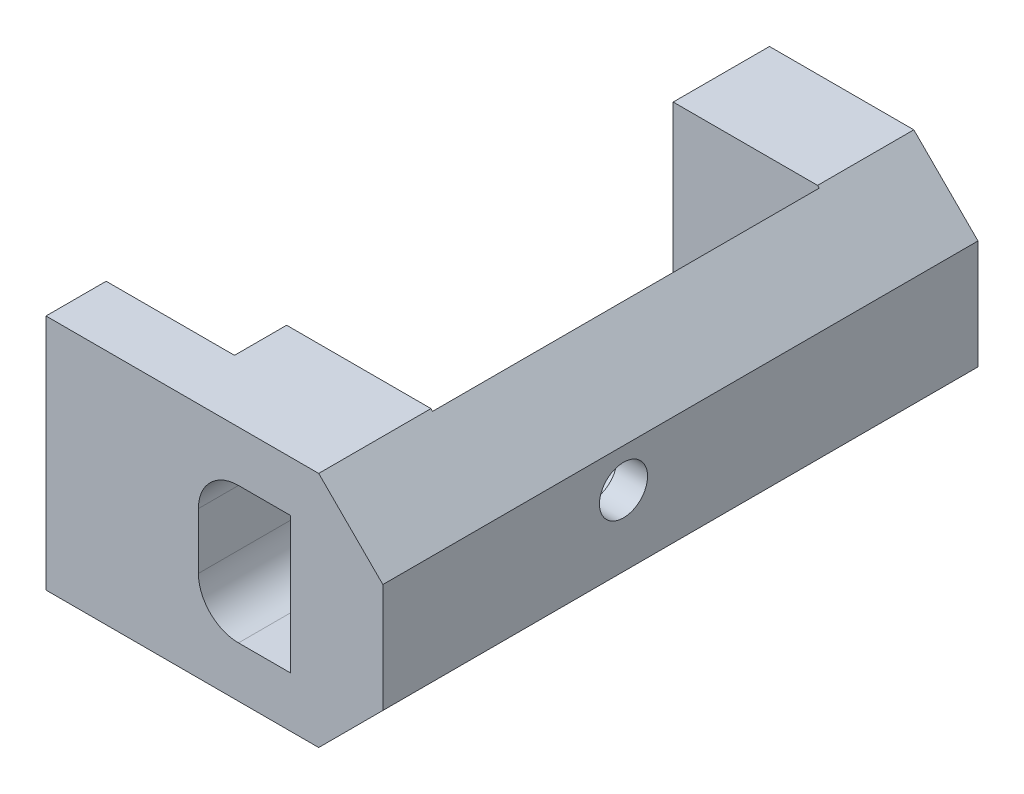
ISO-10303-21;
HEADER;
FILE_DESCRIPTION(('STEP AP214'),'2;1');
FILE_NAME('part.step','',(''),(''),'','','');
FILE_SCHEMA(('AUTOMOTIVE_DESIGN { 1 0 10303 214 1 1 1 1 }'));
ENDSEC;
DATA;
#1=APPLICATION_CONTEXT('core data for automotive mechanical design processes');
#2=APPLICATION_PROTOCOL_DEFINITION('international standard','automotive_design',2000,#1);
#3=PRODUCT_CONTEXT('',#1,'mechanical');
#4=PRODUCT('Part','Part','',(#3));
#5=PRODUCT_RELATED_PRODUCT_CATEGORY('part','',(#4));
#6=PRODUCT_DEFINITION_FORMATION('','',#4);
#7=PRODUCT_DEFINITION_CONTEXT('part definition',#1,'design');
#8=PRODUCT_DEFINITION('design','',#6,#7);
#9=PRODUCT_DEFINITION_SHAPE('','',#8);
#10=(LENGTH_UNIT() NAMED_UNIT(*) SI_UNIT(.MILLI.,.METRE.));
#11=(NAMED_UNIT(*) PLANE_ANGLE_UNIT() SI_UNIT($,.RADIAN.));
#12=(NAMED_UNIT(*) SI_UNIT($,.STERADIAN.) SOLID_ANGLE_UNIT());
#13=UNCERTAINTY_MEASURE_WITH_UNIT(LENGTH_MEASURE(1.E-05),#10,'distance_accuracy_value','');
#14=(GEOMETRIC_REPRESENTATION_CONTEXT(3) GLOBAL_UNCERTAINTY_ASSIGNED_CONTEXT((#13)) GLOBAL_UNIT_ASSIGNED_CONTEXT((#10,
#11,#12)) REPRESENTATION_CONTEXT('',''));
#15=CARTESIAN_POINT('',(0.,0.,0.));
#16=DIRECTION('',(0.,0.,1.));
#17=DIRECTION('',(1.,0.,0.));
#18=AXIS2_PLACEMENT_3D('',#15,#16,#17);
#19=CARTESIAN_POINT('',(0.,14.8,0.));
#20=DIRECTION('',(0.,-1.,0.));
#21=DIRECTION('',(0.,0.,-1.));
#22=AXIS2_PLACEMENT_3D('',#19,#20,#21);
#23=PLANE('',#22);
#24=DIRECTION('',(1.,0.,0.));
#25=VECTOR('',#24,1.);
#26=CARTESIAN_POINT('',(0.,14.8,-4.));
#27=LINE('',#26,#25);
#28=CARTESIAN_POINT('',(0.,14.8,-4.));
#29=VERTEX_POINT('',#28);
#30=CARTESIAN_POINT('',(8.99999999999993,14.8,-4.));
#31=VERTEX_POINT('',#30);
#32=EDGE_CURVE('E226',#29,#31,#27,.T.);
#33=ORIENTED_EDGE('',*,*,#32,.F.);
#34=DIRECTION('',(0.,0.,1.));
#35=VECTOR('',#34,1.);
#36=CARTESIAN_POINT('',(0.,14.8,0.));
#37=LINE('',#36,#35);
#38=CARTESIAN_POINT('',(0.,14.8,-0.750000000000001));
#39=VERTEX_POINT('',#38);
#40=EDGE_CURVE('E225',#29,#39,#37,.T.);
#41=ORIENTED_EDGE('',*,*,#40,.T.);
#42=DIRECTION('',(1.,0.,0.));
#43=VECTOR('',#42,1.);
#44=CARTESIAN_POINT('',(-8.,14.8,-0.749999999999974));
#45=LINE('',#44,#43);
#46=CARTESIAN_POINT('',(-8.,14.8,-0.749999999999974));
#47=VERTEX_POINT('',#46);
#48=EDGE_CURVE('E365',#47,#39,#45,.T.);
#49=ORIENTED_EDGE('',*,*,#48,.F.);
#50=DIRECTION('',(0.,0.,-1.));
#51=VECTOR('',#50,1.);
#52=CARTESIAN_POINT('',(-8.,14.8,0.));
#53=LINE('',#52,#51);
#54=CARTESIAN_POINT('',(-7.99999999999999,14.8,3.00000000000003));
#55=VERTEX_POINT('',#54);
#56=EDGE_CURVE('E363',#55,#47,#53,.T.);
#57=ORIENTED_EDGE('',*,*,#56,.F.);
#58=DIRECTION('',(-1.,0.,0.));
#59=VECTOR('',#58,1.);
#60=CARTESIAN_POINT('',(8.99999999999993,14.8,3.));
#61=LINE('',#60,#59);
#62=CARTESIAN_POINT('',(8.99999999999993,14.8,3.));
#63=VERTEX_POINT('',#62);
#64=EDGE_CURVE('E382',#63,#55,#61,.T.);
#65=ORIENTED_EDGE('',*,*,#64,.F.);
#66=DIRECTION('',(0.,0.,-1.));
#67=VECTOR('',#66,1.);
#68=CARTESIAN_POINT('',(8.99999999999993,14.8,0.));
#69=LINE('',#68,#67);
#70=EDGE_CURVE('E256',#63,#31,#69,.T.);
#71=ORIENTED_EDGE('',*,*,#70,.T.);
#72=EDGE_LOOP('',(#33,#41,#49,#57,#65,#71));
#73=FACE_BOUND('',#72,.T.);
#74=ADVANCED_FACE('F35',(#73),#23,.F.);
#75=CARTESIAN_POINT('',(0.,14.8,0.));
#76=DIRECTION('',(1.,0.,0.));
#77=DIRECTION('',(0.,0.,-1.));
#78=AXIS2_PLACEMENT_3D('',#75,#76,#77);
#79=PLANE('',#78);
#80=DIRECTION('',(0.,1.,0.));
#81=VECTOR('',#80,1.);
#82=CARTESIAN_POINT('',(0.,0.,-4.));
#83=LINE('',#82,#81);
#84=CARTESIAN_POINT('',(0.,0.,-4.));
#85=VERTEX_POINT('',#84);
#86=EDGE_CURVE('E211',#85,#29,#83,.T.);
#87=ORIENTED_EDGE('',*,*,#86,.F.);
#88=DIRECTION('',(0.,0.,1.));
#89=VECTOR('',#88,1.);
#90=CARTESIAN_POINT('',(0.,0.,0.));
#91=LINE('',#90,#89);
#92=CARTESIAN_POINT('',(0.,0.,-0.750000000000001));
#93=VERTEX_POINT('',#92);
#94=EDGE_CURVE('E223',#85,#93,#91,.T.);
#95=ORIENTED_EDGE('',*,*,#94,.T.);
#96=DIRECTION('',(0.,1.,0.));
#97=VECTOR('',#96,1.);
#98=CARTESIAN_POINT('',(0.,0.,-0.750000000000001));
#99=LINE('',#98,#97);
#100=EDGE_CURVE('E344',#93,#39,#99,.T.);
#101=ORIENTED_EDGE('',*,*,#100,.T.);
#102=ORIENTED_EDGE('',*,*,#40,.F.);
#103=EDGE_LOOP('',(#87,#95,#101,#102));
#104=FACE_BOUND('',#103,.T.);
#105=ADVANCED_FACE('F221',(#104),#79,.F.);
#106=CARTESIAN_POINT('',(0.,0.,0.));
#107=DIRECTION('',(0.,-1.,0.));
#108=DIRECTION('',(0.,0.,-1.));
#109=AXIS2_PLACEMENT_3D('',#106,#107,#108);
#110=PLANE('',#109);
#111=ORIENTED_EDGE('',*,*,#94,.F.);
#112=DIRECTION('',(-1.,0.,0.));
#113=VECTOR('',#112,1.);
#114=CARTESIAN_POINT('',(8.99999999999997,0.,-4.));
#115=LINE('',#114,#113);
#116=CARTESIAN_POINT('',(8.99999999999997,0.,-4.));
#117=VERTEX_POINT('',#116);
#118=EDGE_CURVE('E208',#117,#85,#115,.T.);
#119=ORIENTED_EDGE('',*,*,#118,.F.);
#120=DIRECTION('',(0.,0.,1.));
#121=VECTOR('',#120,1.);
#122=CARTESIAN_POINT('',(8.99999999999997,0.,0.));
#123=LINE('',#122,#121);
#124=CARTESIAN_POINT('',(8.99999999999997,0.,3.));
#125=VERTEX_POINT('',#124);
#126=EDGE_CURVE('E270',#117,#125,#123,.T.);
#127=ORIENTED_EDGE('',*,*,#126,.T.);
#128=DIRECTION('',(1.,0.,0.));
#129=VECTOR('',#128,1.);
#130=CARTESIAN_POINT('',(0.,0.,3.));
#131=LINE('',#130,#129);
#132=CARTESIAN_POINT('',(-7.99999999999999,0.,3.00000000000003));
#133=VERTEX_POINT('',#132);
#134=EDGE_CURVE('E370',#133,#125,#131,.T.);
#135=ORIENTED_EDGE('',*,*,#134,.F.);
#136=DIRECTION('',(0.,0.,1.));
#137=VECTOR('',#136,1.);
#138=CARTESIAN_POINT('',(-8.,0.,0.));
#139=LINE('',#138,#137);
#140=CARTESIAN_POINT('',(-8.,0.,-0.749999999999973));
#141=VERTEX_POINT('',#140);
#142=EDGE_CURVE('E357',#141,#133,#139,.T.);
#143=ORIENTED_EDGE('',*,*,#142,.F.);
#144=DIRECTION('',(1.,0.,0.));
#145=VECTOR('',#144,1.);
#146=CARTESIAN_POINT('',(-8.,0.,-0.749999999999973));
#147=LINE('',#146,#145);
#148=EDGE_CURVE('E230',#141,#93,#147,.T.);
#149=ORIENTED_EDGE('',*,*,#148,.T.);
#150=EDGE_LOOP('',(#111,#119,#127,#135,#143,#149));
#151=FACE_BOUND('',#150,.T.);
#152=ADVANCED_FACE('F228',(#151),#110,.T.);
#153=CARTESIAN_POINT('',(4.,9.15,-5.));
#154=DIRECTION('',(0.,0.,1.));
#155=DIRECTION('',(1.,0.,0.));
#156=AXIS2_PLACEMENT_3D('',#153,#154,#155);
#157=CYLINDRICAL_SURFACE('',#156,2.5);
#158=CARTESIAN_POINT('',(4.,9.15,-4.));
#159=DIRECTION('',(0.,0.,-1.));
#160=DIRECTION('',(-1.,0.,0.));
#161=AXIS2_PLACEMENT_3D('',#158,#159,#160);
#162=CIRCLE('',#161,2.5);
#163=CARTESIAN_POINT('',(4.,11.65,-4.));
#164=VERTEX_POINT('',#163);
#165=CARTESIAN_POINT('',(1.5,9.15,-4.));
#166=VERTEX_POINT('',#165);
#167=EDGE_CURVE('E57',#164,#166,#162,.F.);
#168=ORIENTED_EDGE('',*,*,#167,.F.);
#169=DIRECTION('',(0.,0.,1.));
#170=VECTOR('',#169,1.);
#171=CARTESIAN_POINT('',(4.,11.65,-5.));
#172=LINE('',#171,#170);
#173=CARTESIAN_POINT('',(4.,11.65,3.));
#174=VERTEX_POINT('',#173);
#175=EDGE_CURVE('E342',#164,#174,#172,.T.);
#176=ORIENTED_EDGE('',*,*,#175,.T.);
#177=CARTESIAN_POINT('',(4.,9.15,3.));
#178=DIRECTION('',(0.,0.,1.));
#179=DIRECTION('',(1.,0.,0.));
#180=AXIS2_PLACEMENT_3D('',#177,#178,#179);
#181=CIRCLE('',#180,2.5);
#182=CARTESIAN_POINT('',(1.5,9.15,3.));
#183=VERTEX_POINT('',#182);
#184=EDGE_CURVE('E323',#174,#183,#181,.T.);
#185=ORIENTED_EDGE('',*,*,#184,.T.);
#186=DIRECTION('',(0.,0.,1.));
#187=VECTOR('',#186,1.);
#188=CARTESIAN_POINT('',(1.5,9.15,-5.));
#189=LINE('',#188,#187);
#190=EDGE_CURVE('E341',#166,#183,#189,.T.);
#191=ORIENTED_EDGE('',*,*,#190,.F.);
#192=EDGE_LOOP('',(#168,#176,#185,#191));
#193=FACE_BOUND('',#192,.T.);
#194=ADVANCED_FACE('F486',(#193),#157,.F.);
#195=CARTESIAN_POINT('',(7.25,11.65,-5.));
#196=DIRECTION('',(0.,1.,0.));
#197=DIRECTION('',(0.,0.,1.));
#198=AXIS2_PLACEMENT_3D('',#195,#196,#197);
#199=PLANE('',#198);
#200=DIRECTION('',(-1.,0.,0.));
#201=VECTOR('',#200,1.);
#202=CARTESIAN_POINT('',(7.25,11.65,-4.));
#203=LINE('',#202,#201);
#204=CARTESIAN_POINT('',(7.25,11.65,-4.));
#205=VERTEX_POINT('',#204);
#206=EDGE_CURVE('E299',#205,#164,#203,.T.);
#207=ORIENTED_EDGE('',*,*,#206,.F.);
#208=DIRECTION('',(0.,0.,1.));
#209=VECTOR('',#208,1.);
#210=CARTESIAN_POINT('',(7.25,11.65,-5.));
#211=LINE('',#210,#209);
#212=CARTESIAN_POINT('',(7.25,11.65,3.));
#213=VERTEX_POINT('',#212);
#214=EDGE_CURVE('E345',#205,#213,#211,.T.);
#215=ORIENTED_EDGE('',*,*,#214,.T.);
#216=DIRECTION('',(-1.,0.,0.));
#217=VECTOR('',#216,1.);
#218=CARTESIAN_POINT('',(7.25,11.65,3.));
#219=LINE('',#218,#217);
#220=EDGE_CURVE('E338',#213,#174,#219,.T.);
#221=ORIENTED_EDGE('',*,*,#220,.T.);
#222=ORIENTED_EDGE('',*,*,#175,.F.);
#223=EDGE_LOOP('',(#207,#215,#221,#222));
#224=FACE_BOUND('',#223,.T.);
#225=ADVANCED_FACE('F490',(#224),#199,.F.);
#226=CARTESIAN_POINT('',(7.25,11.65,-5.));
#227=DIRECTION('',(1.,0.,0.));
#228=DIRECTION('',(0.,0.,-1.));
#229=AXIS2_PLACEMENT_3D('',#226,#227,#228);
#230=PLANE('',#229);
#231=DIRECTION('',(0.,1.,0.));
#232=VECTOR('',#231,1.);
#233=CARTESIAN_POINT('',(7.25,11.65,-4.));
#234=LINE('',#233,#232);
#235=CARTESIAN_POINT('',(7.25,3.15,-4.));
#236=VERTEX_POINT('',#235);
#237=EDGE_CURVE('E297',#236,#205,#234,.T.);
#238=ORIENTED_EDGE('',*,*,#237,.F.);
#239=DIRECTION('',(0.,0.,1.));
#240=VECTOR('',#239,1.);
#241=CARTESIAN_POINT('',(7.25,3.15,-5.));
#242=LINE('',#241,#240);
#243=CARTESIAN_POINT('',(7.25,3.15,3.));
#244=VERTEX_POINT('',#243);
#245=EDGE_CURVE('E347',#236,#244,#242,.T.);
#246=ORIENTED_EDGE('',*,*,#245,.T.);
#247=DIRECTION('',(0.,1.,0.));
#248=VECTOR('',#247,1.);
#249=CARTESIAN_POINT('',(7.25,11.65,3.));
#250=LINE('',#249,#248);
#251=EDGE_CURVE('E335',#244,#213,#250,.T.);
#252=ORIENTED_EDGE('',*,*,#251,.T.);
#253=ORIENTED_EDGE('',*,*,#214,.F.);
#254=EDGE_LOOP('',(#238,#246,#252,#253));
#255=FACE_BOUND('',#254,.T.);
#256=ADVANCED_FACE('F680',(#255),#230,.F.);
#257=CARTESIAN_POINT('',(7.25,3.15,-5.));
#258=DIRECTION('',(0.,-1.,0.));
#259=DIRECTION('',(1.,0.,0.));
#260=AXIS2_PLACEMENT_3D('',#257,#258,#259);
#261=PLANE('',#260);
#262=DIRECTION('',(1.,0.,0.));
#263=VECTOR('',#262,1.);
#264=CARTESIAN_POINT('',(7.25,3.15,-4.));
#265=LINE('',#264,#263);
#266=CARTESIAN_POINT('',(4.,3.15,-4.));
#267=VERTEX_POINT('',#266);
#268=EDGE_CURVE('E290',#267,#236,#265,.T.);
#269=ORIENTED_EDGE('',*,*,#268,.F.);
#270=DIRECTION('',(0.,0.,1.));
#271=VECTOR('',#270,1.);
#272=CARTESIAN_POINT('',(4.,3.15,-5.));
#273=LINE('',#272,#271);
#274=CARTESIAN_POINT('',(4.,3.15,3.));
#275=VERTEX_POINT('',#274);
#276=EDGE_CURVE('E349',#267,#275,#273,.T.);
#277=ORIENTED_EDGE('',*,*,#276,.T.);
#278=DIRECTION('',(1.,0.,0.));
#279=VECTOR('',#278,1.);
#280=CARTESIAN_POINT('',(7.25,3.15,3.));
#281=LINE('',#280,#279);
#282=EDGE_CURVE('E332',#275,#244,#281,.T.);
#283=ORIENTED_EDGE('',*,*,#282,.T.);
#284=ORIENTED_EDGE('',*,*,#245,.F.);
#285=EDGE_LOOP('',(#269,#277,#283,#284));
#286=FACE_BOUND('',#285,.T.);
#287=ADVANCED_FACE('F506',(#286),#261,.F.);
#288=CARTESIAN_POINT('',(4.,5.65,-5.));
#289=DIRECTION('',(0.,0.,1.));
#290=DIRECTION('',(1.,0.,0.));
#291=AXIS2_PLACEMENT_3D('',#288,#289,#290);
#292=CYLINDRICAL_SURFACE('',#291,2.5);
#293=CARTESIAN_POINT('',(4.,5.65,-4.));
#294=DIRECTION('',(0.,0.,-1.));
#295=DIRECTION('',(-1.,0.,0.));
#296=AXIS2_PLACEMENT_3D('',#293,#294,#295);
#297=CIRCLE('',#296,2.5);
#298=CARTESIAN_POINT('',(1.5,5.65,-4.));
#299=VERTEX_POINT('',#298);
#300=EDGE_CURVE('E287',#299,#267,#297,.F.);
#301=ORIENTED_EDGE('',*,*,#300,.F.);
#302=DIRECTION('',(0.,0.,1.));
#303=VECTOR('',#302,1.);
#304=CARTESIAN_POINT('',(1.5,5.65,-5.));
#305=LINE('',#304,#303);
#306=CARTESIAN_POINT('',(1.5,5.65,3.));
#307=VERTEX_POINT('',#306);
#308=EDGE_CURVE('E351',#299,#307,#305,.T.);
#309=ORIENTED_EDGE('',*,*,#308,.T.);
#310=CARTESIAN_POINT('',(4.,5.65,3.));
#311=DIRECTION('',(0.,0.,1.));
#312=DIRECTION('',(1.,0.,0.));
#313=AXIS2_PLACEMENT_3D('',#310,#311,#312);
#314=CIRCLE('',#313,2.5);
#315=EDGE_CURVE('E329',#307,#275,#314,.T.);
#316=ORIENTED_EDGE('',*,*,#315,.T.);
#317=ORIENTED_EDGE('',*,*,#276,.F.);
#318=EDGE_LOOP('',(#301,#309,#316,#317));
#319=FACE_BOUND('',#318,.T.);
#320=ADVANCED_FACE('F500',(#319),#292,.F.);
#321=CARTESIAN_POINT('',(1.5,9.15,-5.));
#322=DIRECTION('',(-1.,0.,0.));
#323=DIRECTION('',(0.,-1.,0.));
#324=AXIS2_PLACEMENT_3D('',#321,#322,#323);
#325=PLANE('',#324);
#326=DIRECTION('',(0.,-1.,0.));
#327=VECTOR('',#326,1.);
#328=CARTESIAN_POINT('',(1.5,9.15,-4.));
#329=LINE('',#328,#327);
#330=EDGE_CURVE('E11',#166,#299,#329,.T.);
#331=ORIENTED_EDGE('',*,*,#330,.F.);
#332=ORIENTED_EDGE('',*,*,#190,.T.);
#333=DIRECTION('',(0.,-1.,0.));
#334=VECTOR('',#333,1.);
#335=CARTESIAN_POINT('',(1.5,9.15,3.));
#336=LINE('',#335,#334);
#337=EDGE_CURVE('E326',#183,#307,#336,.T.);
#338=ORIENTED_EDGE('',*,*,#337,.T.);
#339=ORIENTED_EDGE('',*,*,#308,.F.);
#340=EDGE_LOOP('',(#331,#332,#338,#339));
#341=FACE_BOUND('',#340,.T.);
#342=ADVANCED_FACE('F494',(#341),#325,.F.);
#343=DIRECTION('',(0.,0.,1.));
#344=VECTOR('',#343,1.);
#345=CARTESIAN_POINT('',(0.,0.,-33.1));
#346=LINE('',#345,#344);
#347=CARTESIAN_POINT('',(0.,0.,-34.1));
#348=VERTEX_POINT('',#347);
#349=CARTESIAN_POINT('',(0.,0.,-28.1));
#350=VERTEX_POINT('',#349);
#351=EDGE_CURVE('E232',#348,#350,#346,.T.);
#352=ORIENTED_EDGE('',*,*,#351,.F.);
#353=DIRECTION('',(-1.,0.,0.));
#354=VECTOR('',#353,1.);
#355=CARTESIAN_POINT('',(0.,0.,-34.1));
#356=LINE('',#355,#354);
#357=CARTESIAN_POINT('',(8.99999999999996,0.,-34.1));
#358=VERTEX_POINT('',#357);
#359=EDGE_CURVE('E276',#358,#348,#356,.T.);
#360=ORIENTED_EDGE('',*,*,#359,.F.);
#361=DIRECTION('',(0.,0.,1.));
#362=VECTOR('',#361,1.);
#363=CARTESIAN_POINT('',(8.99999999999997,0.,0.));
#364=LINE('',#363,#362);
#365=CARTESIAN_POINT('',(8.99999999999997,0.,-28.1));
#366=VERTEX_POINT('',#365);
#367=EDGE_CURVE('E43',#358,#366,#364,.T.);
#368=ORIENTED_EDGE('',*,*,#367,.T.);
#369=DIRECTION('',(1.,0.,0.));
#370=VECTOR('',#369,1.);
#371=CARTESIAN_POINT('',(0.,0.,-28.1));
#372=LINE('',#371,#370);
#373=EDGE_CURVE('E235',#350,#366,#372,.T.);
#374=ORIENTED_EDGE('',*,*,#373,.F.);
#375=EDGE_LOOP('',(#352,#360,#368,#374));
#376=FACE_BOUND('',#375,.T.);
#377=ADVANCED_FACE('F274',(#376),#110,.T.);
#378=CARTESIAN_POINT('',(3.,8.4,-12.));
#379=DIRECTION('',(1.,0.,0.));
#380=DIRECTION('',(0.,0.,-1.));
#381=AXIS2_PLACEMENT_3D('',#378,#379,#380);
#382=CYLINDRICAL_SURFACE('',#381,1.5);
#383=CARTESIAN_POINT('',(13.,8.4,-12.));
#384=DIRECTION('',(1.,0.,0.));
#385=DIRECTION('',(0.,0.,-1.));
#386=AXIS2_PLACEMENT_3D('',#383,#384,#385);
#387=CIRCLE('',#386,1.5);
#388=CARTESIAN_POINT('',(13.,8.4,-13.5));
#389=VERTEX_POINT('',#388);
#390=EDGE_CURVE('E233',#389,#389,#387,.T.);
#391=ORIENTED_EDGE('',*,*,#390,.T.);
#392=EDGE_LOOP('',(#391));
#393=FACE_BOUND('',#392,.T.);
#394=CARTESIAN_POINT('',(11.1,8.4,-12.));
#395=DIRECTION('',(-1.,0.,0.));
#396=DIRECTION('',(0.,0.,1.));
#397=AXIS2_PLACEMENT_3D('',#394,#395,#396);
#398=CIRCLE('',#397,1.5);
#399=CARTESIAN_POINT('',(11.1,8.4,-10.5));
#400=VERTEX_POINT('',#399);
#401=EDGE_CURVE('E238',#400,#400,#398,.F.);
#402=ORIENTED_EDGE('',*,*,#401,.F.);
#403=EDGE_LOOP('',(#402));
#404=FACE_BOUND('',#403,.T.);
#405=ADVANCED_FACE('F458',(#393,#404),#382,.F.);
#406=CARTESIAN_POINT('',(13.,14.8,0.));
#407=DIRECTION('',(-1.,0.,0.));
#408=DIRECTION('',(0.,0.,1.));
#409=AXIS2_PLACEMENT_3D('',#406,#407,#408);
#410=PLANE('',#409);
#411=ORIENTED_EDGE('',*,*,#390,.F.);
#412=EDGE_LOOP('',(#411));
#413=FACE_BOUND('',#412,.T.);
#414=DIRECTION('',(0.,0.,-1.));
#415=VECTOR('',#414,1.);
#416=CARTESIAN_POINT('',(13.,4.00000000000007,-33.1));
#417=LINE('',#416,#415);
#418=CARTESIAN_POINT('',(13.,4.00000000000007,3.));
#419=VERTEX_POINT('',#418);
#420=CARTESIAN_POINT('',(13.,4.00000000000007,-34.1));
#421=VERTEX_POINT('',#420);
#422=EDGE_CURVE('E266',#419,#421,#417,.T.);
#423=ORIENTED_EDGE('',*,*,#422,.T.);
#424=DIRECTION('',(0.,-1.,0.));
#425=VECTOR('',#424,1.);
#426=CARTESIAN_POINT('',(13.,4.00000000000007,-34.1));
#427=LINE('',#426,#425);
#428=CARTESIAN_POINT('',(13.,10.8,-34.1));
#429=VERTEX_POINT('',#428);
#430=EDGE_CURVE('E314',#429,#421,#427,.T.);
#431=ORIENTED_EDGE('',*,*,#430,.F.);
#432=DIRECTION('',(0.,0.,1.));
#433=VECTOR('',#432,1.);
#434=CARTESIAN_POINT('',(13.,10.8,0.));
#435=LINE('',#434,#433);
#436=CARTESIAN_POINT('',(13.,10.8,3.));
#437=VERTEX_POINT('',#436);
#438=EDGE_CURVE('E268',#429,#437,#435,.T.);
#439=ORIENTED_EDGE('',*,*,#438,.T.);
#440=DIRECTION('',(0.,1.,0.));
#441=VECTOR('',#440,1.);
#442=CARTESIAN_POINT('',(13.,4.00000000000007,3.));
#443=LINE('',#442,#441);
#444=EDGE_CURVE('E376',#419,#437,#443,.T.);
#445=ORIENTED_EDGE('',*,*,#444,.F.);
#446=EDGE_LOOP('',(#423,#431,#439,#445));
#447=FACE_BOUND('',#446,.T.);
#448=ADVANCED_FACE('F449',(#413,#447),#410,.F.);
#449=CARTESIAN_POINT('',(0.,14.8,-33.1));
#450=DIRECTION('',(1.,0.,0.));
#451=DIRECTION('',(0.,0.,-1.));
#452=AXIS2_PLACEMENT_3D('',#449,#450,#451);
#453=PLANE('',#452);
#454=CARTESIAN_POINT('',(1.01164552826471E-13,8.4,-31.1));
#455=DIRECTION('',(-1.,0.,0.));
#456=DIRECTION('',(0.,0.,1.));
#457=AXIS2_PLACEMENT_3D('',#454,#455,#456);
#458=CIRCLE('',#457,1.);
#459=CARTESIAN_POINT('',(0.,8.4,-30.1));
#460=VERTEX_POINT('',#459);
#461=EDGE_CURVE('E302',#460,#460,#458,.T.);
#462=ORIENTED_EDGE('',*,*,#461,.F.);
#463=EDGE_LOOP('',(#462));
#464=FACE_BOUND('',#463,.T.);
#465=ORIENTED_EDGE('',*,*,#351,.T.);
#466=DIRECTION('',(0.,-1.,0.));
#467=VECTOR('',#466,1.);
#468=CARTESIAN_POINT('',(0.,14.8,-28.1));
#469=LINE('',#468,#467);
#470=CARTESIAN_POINT('',(0.,14.8,-28.1));
#471=VERTEX_POINT('',#470);
#472=EDGE_CURVE('E248',#471,#350,#469,.T.);
#473=ORIENTED_EDGE('',*,*,#472,.F.);
#474=DIRECTION('',(0.,0.,1.));
#475=VECTOR('',#474,1.);
#476=CARTESIAN_POINT('',(0.,14.8,-33.1));
#477=LINE('',#476,#475);
#478=CARTESIAN_POINT('',(0.,14.8,-34.1));
#479=VERTEX_POINT('',#478);
#480=EDGE_CURVE('E431',#479,#471,#477,.T.);
#481=ORIENTED_EDGE('',*,*,#480,.F.);
#482=DIRECTION('',(0.,1.,0.));
#483=VECTOR('',#482,1.);
#484=CARTESIAN_POINT('',(0.,14.8,-34.1));
#485=LINE('',#484,#483);
#486=EDGE_CURVE('E320',#348,#479,#485,.T.);
#487=ORIENTED_EDGE('',*,*,#486,.F.);
#488=EDGE_LOOP('',(#465,#473,#481,#487));
#489=FACE_BOUND('',#488,.T.);
#490=ADVANCED_FACE('F447',(#464,#489),#453,.F.);
#491=CARTESIAN_POINT('',(0.,14.8,-28.1));
#492=DIRECTION('',(0.,0.,-1.));
#493=DIRECTION('',(-1.,0.,0.));
#494=AXIS2_PLACEMENT_3D('',#491,#492,#493);
#495=PLANE('',#494);
#496=DIRECTION('',(0.,-1.,0.));
#497=VECTOR('',#496,1.);
#498=CARTESIAN_POINT('',(9.09999999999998,14.8,-28.1));
#499=LINE('',#498,#497);
#500=CARTESIAN_POINT('',(9.09999999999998,14.6999999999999,-28.1));
#501=VERTEX_POINT('',#500);
#502=CARTESIAN_POINT('',(9.09999999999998,0.100000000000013,-28.1));
#503=VERTEX_POINT('',#502);
#504=EDGE_CURVE('E246',#501,#503,#499,.T.);
#505=ORIENTED_EDGE('',*,*,#504,.F.);
#506=DIRECTION('',(0.707106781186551,-0.707106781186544,0.));
#507=VECTOR('',#506,1.);
#508=CARTESIAN_POINT('',(8.99999999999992,14.8,-28.1));
#509=LINE('',#508,#507);
#510=CARTESIAN_POINT('',(8.99999999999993,14.8,-28.1));
#511=VERTEX_POINT('',#510);
#512=EDGE_CURVE('E264',#501,#511,#509,.F.);
#513=ORIENTED_EDGE('',*,*,#512,.T.);
#514=DIRECTION('',(1.,0.,0.));
#515=VECTOR('',#514,1.);
#516=CARTESIAN_POINT('',(0.,14.8,-28.1));
#517=LINE('',#516,#515);
#518=EDGE_CURVE('E241',#471,#511,#517,.T.);
#519=ORIENTED_EDGE('',*,*,#518,.F.);
#520=ORIENTED_EDGE('',*,*,#472,.T.);
#521=ORIENTED_EDGE('',*,*,#373,.T.);
#522=DIRECTION('',(0.707106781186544,0.707106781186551,0.));
#523=VECTOR('',#522,1.);
#524=CARTESIAN_POINT('',(13.,4.00000000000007,-28.1));
#525=LINE('',#524,#523);
#526=EDGE_CURVE('E262',#366,#503,#525,.T.);
#527=ORIENTED_EDGE('',*,*,#526,.T.);
#528=EDGE_LOOP('',(#505,#513,#519,#520,#521,#527));
#529=FACE_BOUND('',#528,.T.);
#530=ADVANCED_FACE('F283',(#529),#495,.F.);
#531=CARTESIAN_POINT('',(9.09999999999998,14.8,-5.));
#532=DIRECTION('',(1.,0.,0.));
#533=DIRECTION('',(0.,0.,-1.));
#534=AXIS2_PLACEMENT_3D('',#531,#532,#533);
#535=PLANE('',#534);
#536=DIRECTION('',(0.,-0.429835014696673,-0.902907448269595));
#537=VECTOR('',#536,1.);
#538=CARTESIAN_POINT('',(9.09999999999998,11.6896323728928,-11.7386212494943));
#539=LINE('',#538,#537);
#540=CARTESIAN_POINT('',(9.09999999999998,11.6896323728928,-11.7386212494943));
#541=VERTEX_POINT('',#540);
#542=CARTESIAN_POINT('',(9.09999999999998,10.2711768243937,-14.718215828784));
#543=VERTEX_POINT('',#542);
#544=EDGE_CURVE('E406',#541,#543,#539,.T.);
#545=ORIENTED_EDGE('',*,*,#544,.F.);
#546=DIRECTION('',(0.,0.567023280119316,-0.823701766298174));
#547=VECTOR('',#546,1.);
#548=CARTESIAN_POINT('',(9.09999999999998,9.81845554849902,-9.02040542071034));
#549=LINE('',#548,#547);
#550=CARTESIAN_POINT('',(9.09999999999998,9.81845554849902,-9.02040542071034));
#551=VERTEX_POINT('',#550);
#552=EDGE_CURVE('E384',#551,#541,#549,.T.);
#553=ORIENTED_EDGE('',*,*,#552,.F.);
#554=DIRECTION('',(0.,0.996858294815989,0.0792056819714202));
#555=VECTOR('',#554,1.);
#556=CARTESIAN_POINT('',(9.09999999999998,6.52882317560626,-9.28178417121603));
#557=LINE('',#556,#555);
#558=CARTESIAN_POINT('',(9.09999999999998,6.52882317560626,-9.28178417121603));
#559=VERTEX_POINT('',#558);
#560=EDGE_CURVE('E389',#559,#551,#557,.T.);
#561=ORIENTED_EDGE('',*,*,#560,.F.);
#562=DIRECTION('',(0.,0.429835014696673,0.902907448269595));
#563=VECTOR('',#562,1.);
#564=CARTESIAN_POINT('',(9.09999999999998,5.11036762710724,-12.2613787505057));
#565=LINE('',#564,#563);
#566=CARTESIAN_POINT('',(9.09999999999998,5.11036762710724,-12.2613787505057));
#567=VERTEX_POINT('',#566);
#568=EDGE_CURVE('E415',#567,#559,#565,.T.);
#569=ORIENTED_EDGE('',*,*,#568,.F.);
#570=DIRECTION('',(0.,-0.567023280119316,0.823701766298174));
#571=VECTOR('',#570,1.);
#572=CARTESIAN_POINT('',(9.09999999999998,6.98154445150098,-14.9795945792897));
#573=LINE('',#572,#571);
#574=CARTESIAN_POINT('',(9.09999999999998,6.98154445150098,-14.9795945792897));
#575=VERTEX_POINT('',#574);
#576=EDGE_CURVE('E412',#575,#567,#573,.T.);
#577=ORIENTED_EDGE('',*,*,#576,.F.);
#578=DIRECTION('',(0.,-0.99685829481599,-0.0792056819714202));
#579=VECTOR('',#578,1.);
#580=CARTESIAN_POINT('',(9.09999999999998,10.2711768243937,-14.718215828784));
#581=LINE('',#580,#579);
#582=EDGE_CURVE('E409',#543,#575,#581,.T.);
#583=ORIENTED_EDGE('',*,*,#582,.F.);
#584=EDGE_LOOP('',(#545,#553,#561,#569,#577,#583));
#585=FACE_BOUND('',#584,.T.);
#586=DIRECTION('',(0.,0.,1.));
#587=VECTOR('',#586,1.);
#588=CARTESIAN_POINT('',(9.09999999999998,0.100000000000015,0.));
#589=LINE('',#588,#587);
#590=CARTESIAN_POINT('',(9.09999999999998,0.100000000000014,-4.));
#591=VERTEX_POINT('',#590);
#592=EDGE_CURVE('E50',#503,#591,#589,.T.);
#593=ORIENTED_EDGE('',*,*,#592,.T.);
#594=DIRECTION('',(0.,-1.,0.));
#595=VECTOR('',#594,1.);
#596=CARTESIAN_POINT('',(9.09999999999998,14.6999999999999,-4.));
#597=LINE('',#596,#595);
#598=CARTESIAN_POINT('',(9.09999999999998,14.6999999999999,-4.));
#599=VERTEX_POINT('',#598);
#600=EDGE_CURVE('E288',#599,#591,#597,.T.);
#601=ORIENTED_EDGE('',*,*,#600,.F.);
#602=DIRECTION('',(0.,0.,1.));
#603=VECTOR('',#602,1.);
#604=CARTESIAN_POINT('',(9.09999999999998,14.6999999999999,0.));
#605=LINE('',#604,#603);
#606=EDGE_CURVE('E260',#599,#501,#605,.F.);
#607=ORIENTED_EDGE('',*,*,#606,.T.);
#608=ORIENTED_EDGE('',*,*,#504,.T.);
#609=EDGE_LOOP('',(#593,#601,#607,#608));
#610=FACE_BOUND('',#609,.T.);
#611=ADVANCED_FACE('F456',(#585,#610),#535,.F.);
#612=ORIENTED_EDGE('',*,*,#518,.T.);
#613=DIRECTION('',(0.,0.,-1.));
#614=VECTOR('',#613,1.);
#615=CARTESIAN_POINT('',(8.99999999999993,14.8,0.));
#616=LINE('',#615,#614);
#617=CARTESIAN_POINT('',(8.99999999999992,14.8,-34.1));
#618=VERTEX_POINT('',#617);
#619=EDGE_CURVE('E251',#511,#618,#616,.T.);
#620=ORIENTED_EDGE('',*,*,#619,.T.);
#621=DIRECTION('',(1.,0.,0.));
#622=VECTOR('',#621,1.);
#623=CARTESIAN_POINT('',(8.99999999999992,14.8,-34.1));
#624=LINE('',#623,#622);
#625=EDGE_CURVE('E306',#479,#618,#624,.T.);
#626=ORIENTED_EDGE('',*,*,#625,.F.);
#627=ORIENTED_EDGE('',*,*,#480,.T.);
#628=EDGE_LOOP('',(#612,#620,#626,#627));
#629=FACE_BOUND('',#628,.T.);
#630=ADVANCED_FACE('F436',(#629),#23,.F.);
#631=CARTESIAN_POINT('',(11.1,0.,0.));
#632=DIRECTION('',(-1.,0.,0.));
#633=DIRECTION('',(0.,0.,1.));
#634=AXIS2_PLACEMENT_3D('',#631,#632,#633);
#635=PLANE('',#634);
#636=DIRECTION('',(0.,0.567023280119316,-0.823701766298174));
#637=VECTOR('',#636,1.);
#638=CARTESIAN_POINT('',(11.1,9.81845554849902,-9.02040542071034));
#639=LINE('',#638,#637);
#640=CARTESIAN_POINT('',(11.1,9.81845554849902,-9.02040542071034));
#641=VERTEX_POINT('',#640);
#642=CARTESIAN_POINT('',(11.1,11.6896323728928,-11.7386212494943));
#643=VERTEX_POINT('',#642);
#644=EDGE_CURVE('E385',#641,#643,#639,.T.);
#645=ORIENTED_EDGE('',*,*,#644,.T.);
#646=DIRECTION('',(0.,-0.429835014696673,-0.902907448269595));
#647=VECTOR('',#646,1.);
#648=CARTESIAN_POINT('',(11.1,11.6896323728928,-11.7386212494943));
#649=LINE('',#648,#647);
#650=CARTESIAN_POINT('',(11.1,10.2711768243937,-14.718215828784));
#651=VERTEX_POINT('',#650);
#652=EDGE_CURVE('E388',#643,#651,#649,.T.);
#653=ORIENTED_EDGE('',*,*,#652,.T.);
#654=DIRECTION('',(0.,-0.99685829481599,-0.0792056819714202));
#655=VECTOR('',#654,1.);
#656=CARTESIAN_POINT('',(11.1,10.2711768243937,-14.718215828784));
#657=LINE('',#656,#655);
#658=CARTESIAN_POINT('',(11.1,6.98154445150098,-14.9795945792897));
#659=VERTEX_POINT('',#658);
#660=EDGE_CURVE('E392',#651,#659,#657,.T.);
#661=ORIENTED_EDGE('',*,*,#660,.T.);
#662=DIRECTION('',(0.,-0.567023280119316,0.823701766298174));
#663=VECTOR('',#662,1.);
#664=CARTESIAN_POINT('',(11.1,6.98154445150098,-14.9795945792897));
#665=LINE('',#664,#663);
#666=CARTESIAN_POINT('',(11.1,5.11036762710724,-12.2613787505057));
#667=VERTEX_POINT('',#666);
#668=EDGE_CURVE('E395',#659,#667,#665,.T.);
#669=ORIENTED_EDGE('',*,*,#668,.T.);
#670=DIRECTION('',(0.,0.429835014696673,0.902907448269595));
#671=VECTOR('',#670,1.);
#672=CARTESIAN_POINT('',(11.1,5.11036762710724,-12.2613787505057));
#673=LINE('',#672,#671);
#674=CARTESIAN_POINT('',(11.1,6.52882317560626,-9.28178417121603));
#675=VERTEX_POINT('',#674);
#676=EDGE_CURVE('E398',#667,#675,#673,.T.);
#677=ORIENTED_EDGE('',*,*,#676,.T.);
#678=DIRECTION('',(0.,0.996858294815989,0.0792056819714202));
#679=VECTOR('',#678,1.);
#680=CARTESIAN_POINT('',(11.1,6.52882317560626,-9.28178417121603));
#681=LINE('',#680,#679);
#682=EDGE_CURVE('E401',#675,#641,#681,.T.);
#683=ORIENTED_EDGE('',*,*,#682,.T.);
#684=EDGE_LOOP('',(#645,#653,#661,#669,#677,#683));
#685=FACE_BOUND('',#684,.T.);
#686=ORIENTED_EDGE('',*,*,#401,.T.);
#687=EDGE_LOOP('',(#686));
#688=FACE_BOUND('',#687,.T.);
#689=ADVANCED_FACE('F472',(#685,#688),#635,.T.);
#690=CARTESIAN_POINT('',(11.1,9.81845554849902,-9.02040542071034));
#691=DIRECTION('',(0.,0.823701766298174,0.567023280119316));
#692=DIRECTION('',(0.,-0.567023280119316,0.823701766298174));
#693=AXIS2_PLACEMENT_3D('',#690,#691,#692);
#694=PLANE('',#693);
#695=ORIENTED_EDGE('',*,*,#552,.T.);
#696=DIRECTION('',(-1.,0.,0.));
#697=VECTOR('',#696,1.);
#698=CARTESIAN_POINT('',(11.1,11.6896323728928,-11.7386212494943));
#699=LINE('',#698,#697);
#700=EDGE_CURVE('E404',#643,#541,#699,.T.);
#701=ORIENTED_EDGE('',*,*,#700,.F.);
#702=ORIENTED_EDGE('',*,*,#644,.F.);
#703=DIRECTION('',(-1.,0.,0.));
#704=VECTOR('',#703,1.);
#705=CARTESIAN_POINT('',(11.1,9.81845554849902,-9.02040542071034));
#706=LINE('',#705,#704);
#707=EDGE_CURVE('E254',#641,#551,#706,.T.);
#708=ORIENTED_EDGE('',*,*,#707,.T.);
#709=EDGE_LOOP('',(#695,#701,#702,#708));
#710=FACE_BOUND('',#709,.T.);
#711=ADVANCED_FACE('F477',(#710),#694,.F.);
#712=CARTESIAN_POINT('',(11.1,6.52882317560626,-9.28178417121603));
#713=DIRECTION('',(0.,-0.0792056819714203,0.99685829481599));
#714=DIRECTION('',(0.,-0.99685829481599,-0.0792056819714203));
#715=AXIS2_PLACEMENT_3D('',#712,#713,#714);
#716=PLANE('',#715);
#717=ORIENTED_EDGE('',*,*,#560,.T.);
#718=ORIENTED_EDGE('',*,*,#707,.F.);
#719=ORIENTED_EDGE('',*,*,#682,.F.);
#720=DIRECTION('',(-1.,0.,0.));
#721=VECTOR('',#720,1.);
#722=CARTESIAN_POINT('',(11.1,6.52882317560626,-9.28178417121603));
#723=LINE('',#722,#721);
#724=EDGE_CURVE('E421',#675,#559,#723,.T.);
#725=ORIENTED_EDGE('',*,*,#724,.T.);
#726=EDGE_LOOP('',(#717,#718,#719,#725));
#727=FACE_BOUND('',#726,.T.);
#728=ADVANCED_FACE('F523',(#727),#716,.F.);
#729=CARTESIAN_POINT('',(11.1,5.11036762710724,-12.2613787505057));
#730=DIRECTION('',(0.,-0.902907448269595,0.429835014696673));
#731=DIRECTION('',(0.,-0.429835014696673,-0.902907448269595));
#732=AXIS2_PLACEMENT_3D('',#729,#730,#731);
#733=PLANE('',#732);
#734=ORIENTED_EDGE('',*,*,#568,.T.);
#735=ORIENTED_EDGE('',*,*,#724,.F.);
#736=ORIENTED_EDGE('',*,*,#676,.F.);
#737=DIRECTION('',(-1.,0.,0.));
#738=VECTOR('',#737,1.);
#739=CARTESIAN_POINT('',(11.1,5.11036762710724,-12.2613787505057));
#740=LINE('',#739,#738);
#741=EDGE_CURVE('E423',#667,#567,#740,.T.);
#742=ORIENTED_EDGE('',*,*,#741,.T.);
#743=EDGE_LOOP('',(#734,#735,#736,#742));
#744=FACE_BOUND('',#743,.T.);
#745=ADVANCED_FACE('F526',(#744),#733,.F.);
#746=CARTESIAN_POINT('',(11.1,6.98154445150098,-14.9795945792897));
#747=DIRECTION('',(0.,-0.823701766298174,-0.567023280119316));
#748=DIRECTION('',(0.,0.567023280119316,-0.823701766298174));
#749=AXIS2_PLACEMENT_3D('',#746,#747,#748);
#750=PLANE('',#749);
#751=ORIENTED_EDGE('',*,*,#576,.T.);
#752=ORIENTED_EDGE('',*,*,#741,.F.);
#753=ORIENTED_EDGE('',*,*,#668,.F.);
#754=DIRECTION('',(-1.,0.,0.));
#755=VECTOR('',#754,1.);
#756=CARTESIAN_POINT('',(11.1,6.98154445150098,-14.9795945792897));
#757=LINE('',#756,#755);
#758=EDGE_CURVE('E425',#659,#575,#757,.T.);
#759=ORIENTED_EDGE('',*,*,#758,.T.);
#760=EDGE_LOOP('',(#751,#752,#753,#759));
#761=FACE_BOUND('',#760,.T.);
#762=ADVANCED_FACE('F530',(#761),#750,.F.);
#763=CARTESIAN_POINT('',(11.1,10.2711768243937,-14.718215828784));
#764=DIRECTION('',(0.,0.0792056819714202,-0.99685829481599));
#765=DIRECTION('',(0.,0.99685829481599,0.0792056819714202));
#766=AXIS2_PLACEMENT_3D('',#763,#764,#765);
#767=PLANE('',#766);
#768=ORIENTED_EDGE('',*,*,#582,.T.);
#769=ORIENTED_EDGE('',*,*,#758,.F.);
#770=ORIENTED_EDGE('',*,*,#660,.F.);
#771=DIRECTION('',(-1.,0.,0.));
#772=VECTOR('',#771,1.);
#773=CARTESIAN_POINT('',(11.1,10.2711768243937,-14.718215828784));
#774=LINE('',#773,#772);
#775=EDGE_CURVE('E427',#651,#543,#774,.T.);
#776=ORIENTED_EDGE('',*,*,#775,.T.);
#777=EDGE_LOOP('',(#768,#769,#770,#776));
#778=FACE_BOUND('',#777,.T.);
#779=ADVANCED_FACE('F534',(#778),#767,.F.);
#780=CARTESIAN_POINT('',(11.1,11.6896323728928,-11.7386212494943));
#781=DIRECTION('',(0.,0.902907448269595,-0.429835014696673));
#782=DIRECTION('',(0.,0.429835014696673,0.902907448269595));
#783=AXIS2_PLACEMENT_3D('',#780,#781,#782);
#784=PLANE('',#783);
#785=ORIENTED_EDGE('',*,*,#544,.T.);
#786=ORIENTED_EDGE('',*,*,#775,.F.);
#787=ORIENTED_EDGE('',*,*,#652,.F.);
#788=ORIENTED_EDGE('',*,*,#700,.T.);
#789=EDGE_LOOP('',(#785,#786,#787,#788));
#790=FACE_BOUND('',#789,.T.);
#791=ADVANCED_FACE('F538',(#790),#784,.F.);
#792=CARTESIAN_POINT('',(8.99999999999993,14.8,0.));
#793=DIRECTION('',(-0.707106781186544,-0.707106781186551,0.));
#794=DIRECTION('',(0.,0.,-1.));
#795=AXIS2_PLACEMENT_3D('',#792,#793,#794);
#796=PLANE('',#795);
#797=ORIENTED_EDGE('',*,*,#606,.F.);
#798=DIRECTION('',(0.707106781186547,-0.707106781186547,0.));
#799=VECTOR('',#798,1.);
#800=CARTESIAN_POINT('',(8.99999999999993,14.8,-4.));
#801=LINE('',#800,#799);
#802=EDGE_CURVE('E292',#31,#599,#801,.T.);
#803=ORIENTED_EDGE('',*,*,#802,.F.);
#804=ORIENTED_EDGE('',*,*,#70,.F.);
#805=DIRECTION('',(-0.707106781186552,0.707106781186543,0.));
#806=VECTOR('',#805,1.);
#807=CARTESIAN_POINT('',(13.,10.8,3.));
#808=LINE('',#807,#806);
#809=EDGE_CURVE('E379',#437,#63,#808,.T.);
#810=ORIENTED_EDGE('',*,*,#809,.F.);
#811=ORIENTED_EDGE('',*,*,#438,.F.);
#812=DIRECTION('',(0.707106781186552,-0.707106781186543,0.));
#813=VECTOR('',#812,1.);
#814=CARTESIAN_POINT('',(13.,10.8,-34.1));
#815=LINE('',#814,#813);
#816=EDGE_CURVE('E311',#618,#429,#815,.T.);
#817=ORIENTED_EDGE('',*,*,#816,.F.);
#818=ORIENTED_EDGE('',*,*,#619,.F.);
#819=ORIENTED_EDGE('',*,*,#512,.F.);
#820=EDGE_LOOP('',(#797,#803,#804,#810,#811,#817,#818,#819));
#821=FACE_BOUND('',#820,.T.);
#822=ADVANCED_FACE('F440',(#821),#796,.F.);
#823=CARTESIAN_POINT('',(13.,4.00000000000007,0.));
#824=DIRECTION('',(0.707106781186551,-0.707106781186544,0.));
#825=DIRECTION('',(0.,0.,1.));
#826=AXIS2_PLACEMENT_3D('',#823,#824,#825);
#827=PLANE('',#826);
#828=DIRECTION('',(-0.707106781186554,-0.707106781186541,0.));
#829=VECTOR('',#828,1.);
#830=CARTESIAN_POINT('',(9.09999999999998,0.100000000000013,-4.));
#831=LINE('',#830,#829);
#832=EDGE_CURVE('E214',#591,#117,#831,.T.);
#833=ORIENTED_EDGE('',*,*,#832,.F.);
#834=ORIENTED_EDGE('',*,*,#592,.F.);
#835=ORIENTED_EDGE('',*,*,#526,.F.);
#836=ORIENTED_EDGE('',*,*,#367,.F.);
#837=DIRECTION('',(-0.707106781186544,-0.707106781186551,0.));
#838=VECTOR('',#837,1.);
#839=CARTESIAN_POINT('',(8.99999999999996,0.,-34.1));
#840=LINE('',#839,#838);
#841=EDGE_CURVE('E317',#421,#358,#840,.T.);
#842=ORIENTED_EDGE('',*,*,#841,.F.);
#843=ORIENTED_EDGE('',*,*,#422,.F.);
#844=DIRECTION('',(0.707106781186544,0.707106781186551,0.));
#845=VECTOR('',#844,1.);
#846=CARTESIAN_POINT('',(8.99999999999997,0.,3.));
#847=LINE('',#846,#845);
#848=EDGE_CURVE('E373',#125,#419,#847,.T.);
#849=ORIENTED_EDGE('',*,*,#848,.F.);
#850=ORIENTED_EDGE('',*,*,#126,.F.);
#851=EDGE_LOOP('',(#833,#834,#835,#836,#842,#843,#849,#850));
#852=FACE_BOUND('',#851,.T.);
#853=ADVANCED_FACE('F37',(#852),#827,.T.);
#854=CARTESIAN_POINT('',(0.,0.,3.));
#855=DIRECTION('',(0.,0.,1.));
#856=DIRECTION('',(1.,0.,0.));
#857=AXIS2_PLACEMENT_3D('',#854,#855,#856);
#858=PLANE('',#857);
#859=ORIENTED_EDGE('',*,*,#184,.F.);
#860=ORIENTED_EDGE('',*,*,#220,.F.);
#861=ORIENTED_EDGE('',*,*,#251,.F.);
#862=ORIENTED_EDGE('',*,*,#282,.F.);
#863=ORIENTED_EDGE('',*,*,#315,.F.);
#864=ORIENTED_EDGE('',*,*,#337,.F.);
#865=EDGE_LOOP('',(#859,#860,#861,#862,#863,#864));
#866=FACE_BOUND('',#865,.T.);
#867=ORIENTED_EDGE('',*,*,#64,.T.);
#868=DIRECTION('',(0.,1.,0.));
#869=VECTOR('',#868,1.);
#870=CARTESIAN_POINT('',(-7.99999999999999,0.,3.00000000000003));
#871=LINE('',#870,#869);
#872=EDGE_CURVE('E360',#133,#55,#871,.T.);
#873=ORIENTED_EDGE('',*,*,#872,.F.);
#874=ORIENTED_EDGE('',*,*,#134,.T.);
#875=ORIENTED_EDGE('',*,*,#848,.T.);
#876=ORIENTED_EDGE('',*,*,#444,.T.);
#877=ORIENTED_EDGE('',*,*,#809,.T.);
#878=EDGE_LOOP('',(#867,#873,#874,#875,#876,#877));
#879=FACE_BOUND('',#878,.T.);
#880=ADVANCED_FACE('F518',(#866,#879),#858,.T.);
#881=CARTESIAN_POINT('',(-8.,0.,-0.749999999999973));
#882=DIRECTION('',(0.,0.,-1.));
#883=DIRECTION('',(-1.,0.,0.));
#884=AXIS2_PLACEMENT_3D('',#881,#882,#883);
#885=PLANE('',#884);
#886=ORIENTED_EDGE('',*,*,#100,.F.);
#887=ORIENTED_EDGE('',*,*,#148,.F.);
#888=DIRECTION('',(0.,1.,0.));
#889=VECTOR('',#888,1.);
#890=CARTESIAN_POINT('',(-8.,0.,-0.749999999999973));
#891=LINE('',#890,#889);
#892=EDGE_CURVE('E354',#141,#47,#891,.T.);
#893=ORIENTED_EDGE('',*,*,#892,.T.);
#894=ORIENTED_EDGE('',*,*,#48,.T.);
#895=EDGE_LOOP('',(#886,#887,#893,#894));
#896=FACE_BOUND('',#895,.T.);
#897=ADVANCED_FACE('F514',(#896),#885,.T.);
#898=CARTESIAN_POINT('',(-8.,0.,0.));
#899=DIRECTION('',(-1.,0.,0.));
#900=DIRECTION('',(0.,0.,1.));
#901=AXIS2_PLACEMENT_3D('',#898,#899,#900);
#902=PLANE('',#901);
#903=ORIENTED_EDGE('',*,*,#892,.F.);
#904=ORIENTED_EDGE('',*,*,#142,.T.);
#905=ORIENTED_EDGE('',*,*,#872,.T.);
#906=ORIENTED_EDGE('',*,*,#56,.T.);
#907=EDGE_LOOP('',(#903,#904,#905,#906));
#908=FACE_BOUND('',#907,.T.);
#909=ADVANCED_FACE('F511',(#908),#902,.T.);
#910=CARTESIAN_POINT('',(0.,0.,-34.1));
#911=DIRECTION('',(0.,0.,1.));
#912=DIRECTION('',(1.,0.,0.));
#913=AXIS2_PLACEMENT_3D('',#910,#911,#912);
#914=PLANE('',#913);
#915=ORIENTED_EDGE('',*,*,#625,.T.);
#916=ORIENTED_EDGE('',*,*,#816,.T.);
#917=ORIENTED_EDGE('',*,*,#430,.T.);
#918=ORIENTED_EDGE('',*,*,#841,.T.);
#919=ORIENTED_EDGE('',*,*,#359,.T.);
#920=ORIENTED_EDGE('',*,*,#486,.T.);
#921=EDGE_LOOP('',(#915,#916,#917,#918,#919,#920));
#922=FACE_BOUND('',#921,.T.);
#923=ADVANCED_FACE('F444',(#922),#914,.F.);
#924=CARTESIAN_POINT('',(6.0000000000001,8.4,-31.1));
#925=DIRECTION('',(-1.,0.,0.));
#926=DIRECTION('',(0.,0.,1.));
#927=AXIS2_PLACEMENT_3D('',#924,#925,#926);
#928=CYLINDRICAL_SURFACE('',#927,1.);
#929=CARTESIAN_POINT('',(6.0000000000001,8.4,-31.1));
#930=DIRECTION('',(-1.,0.,0.));
#931=DIRECTION('',(0.,0.,1.));
#932=AXIS2_PLACEMENT_3D('',#929,#930,#931);
#933=CIRCLE('',#932,1.);
#934=CARTESIAN_POINT('',(6.0000000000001,8.4,-30.1));
#935=VERTEX_POINT('',#934);
#936=EDGE_CURVE('E303',#935,#935,#933,.T.);
#937=ORIENTED_EDGE('',*,*,#936,.F.);
#938=EDGE_LOOP('',(#937));
#939=FACE_BOUND('',#938,.T.);
#940=ORIENTED_EDGE('',*,*,#461,.T.);
#941=EDGE_LOOP('',(#940));
#942=FACE_BOUND('',#941,.T.);
#943=ADVANCED_FACE('F613',(#939,#942),#928,.F.);
#944=CARTESIAN_POINT('',(6.0000000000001,8.4,-31.1));
#945=DIRECTION('',(-1.,0.,0.));
#946=DIRECTION('',(0.,0.,1.));
#947=AXIS2_PLACEMENT_3D('',#944,#945,#946);
#948=PLANE('',#947);
#949=ORIENTED_EDGE('',*,*,#936,.T.);
#950=EDGE_LOOP('',(#949));
#951=FACE_BOUND('',#950,.T.);
#952=ADVANCED_FACE('F620',(#951),#948,.T.);
#953=CARTESIAN_POINT('',(0.,0.,-4.));
#954=DIRECTION('',(0.,0.,-1.));
#955=DIRECTION('',(-1.,0.,0.));
#956=AXIS2_PLACEMENT_3D('',#953,#954,#955);
#957=PLANE('',#956);
#958=ORIENTED_EDGE('',*,*,#118,.T.);
#959=ORIENTED_EDGE('',*,*,#86,.T.);
#960=ORIENTED_EDGE('',*,*,#32,.T.);
#961=ORIENTED_EDGE('',*,*,#802,.T.);
#962=ORIENTED_EDGE('',*,*,#600,.T.);
#963=ORIENTED_EDGE('',*,*,#832,.T.);
#964=EDGE_LOOP('',(#958,#959,#960,#961,#962,#963));
#965=FACE_BOUND('',#964,.T.);
#966=ORIENTED_EDGE('',*,*,#167,.T.);
#967=ORIENTED_EDGE('',*,*,#330,.T.);
#968=ORIENTED_EDGE('',*,*,#300,.T.);
#969=ORIENTED_EDGE('',*,*,#268,.T.);
#970=ORIENTED_EDGE('',*,*,#237,.T.);
#971=ORIENTED_EDGE('',*,*,#206,.T.);
#972=EDGE_LOOP('',(#966,#967,#968,#969,#970,#971));
#973=FACE_BOUND('',#972,.T.);
#974=ADVANCED_FACE('F210',(#965,#973),#957,.T.);
#975=CLOSED_SHELL('',(#74,#105,#152,#194,#225,#256,#287,#320,#342,#377,#405,#448,#490,#530,#611,
#630,#689,#711,#728,#745,#762,#779,#791,#822,#853,#880,#897,#909,#923,#943,#952,#974));
#976=MANIFOLD_SOLID_BREP('B2',#975);
#977=ADVANCED_BREP_SHAPE_REPRESENTATION('',(#18,#976),#14);
#978=SHAPE_DEFINITION_REPRESENTATION(#9,#977);
ENDSEC;
END-ISO-10303-21;
